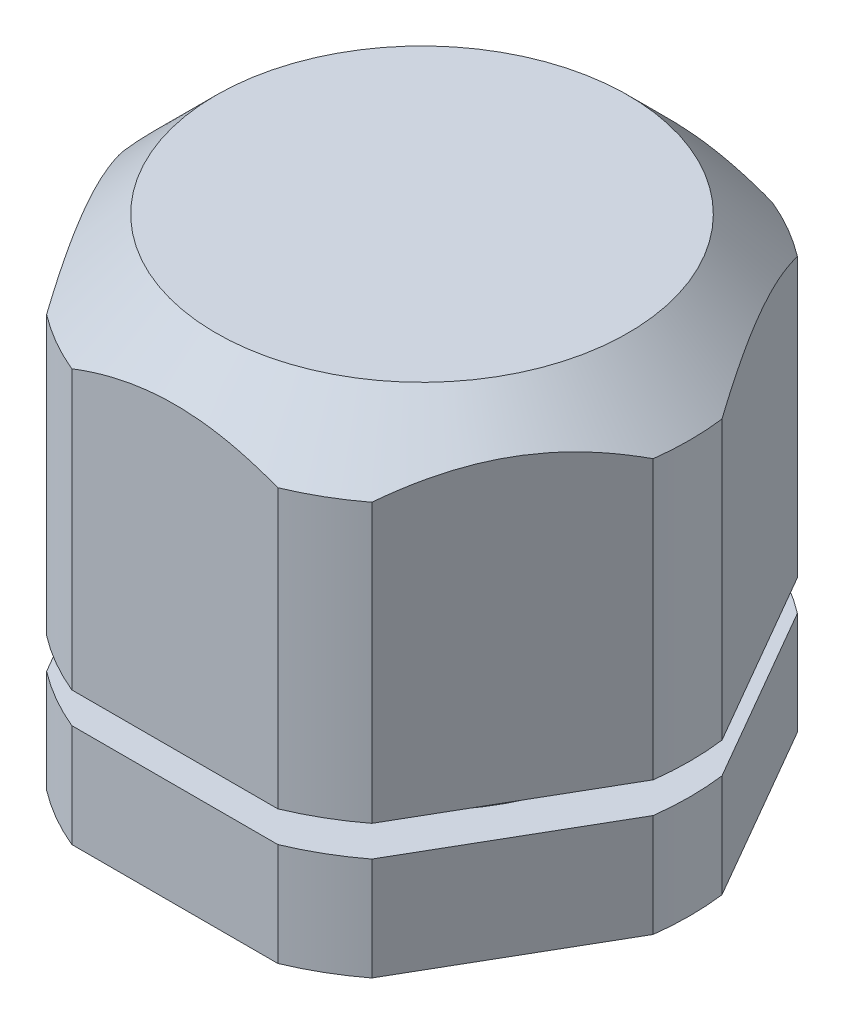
from build123d import *

# Parameters (mm, degrees)
BASE_EXTRUSION_DEPTH    = 23
ESQUISSE3_R             = 13.856406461
ESQUISSE3_R_2           = 13
ENL_V_MAT_EXTRU_1_DEPTH = 30.41088234
ESQUISSE4_W             = 3
ESQUISSE4_H             = 1.5


with BuildPart() as part:
    # Esquisse2 → Base-Extrusion (new body)
    with BuildSketch(Plane(origin=(0, 0, 0), x_dir=(1, 0, 0), z_dir=(0, 1, 0))):
        Polygon((13.856406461, 0), (6.92820323, 12), (-6.92820323, 12), (-13.856406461, 0), (-6.92820323, -12), (6.92820323, -12), align=None)
    extrude(amount=BASE_EXTRUSION_DEPTH)

    # Esquisse3 → Enl_v. mat.-Extru.1 (cut, through all)
    with BuildSketch(Plane(origin=(0, 23, 0), x_dir=(-1, 0, 0), z_dir=(0, 1, 0))):
        Circle(ESQUISSE3_R)
        Circle(ESQUISSE3_R_2, mode=Mode.SUBTRACT)
    extrude(amount=-ENL_V_MAT_EXTRU_1_DEPTH, mode=Mode.SUBTRACT)

    # Esquisse4 → Enl_vement de mati_re-R_volution1 (revolve, cut)
    with BuildSketch(Plane.XY, mode=Mode.PRIVATE) as enl_vement_de_mati_re_r_volution1_sk:
        with Locations((11.5, 5.75)):
            Rectangle(ESQUISSE4_W, ESQUISSE4_H)
        Polygon((10, 23), (13, 20), (13, 23), align=None)
    revolve(enl_vement_de_mati_re_r_volution1_sk.sketch.rotate(Axis((0, 6.229090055, 0), (0, -1, 0)), 180), axis=Axis((0, 6.229090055, 0), (0, -1, 0)), mode=Mode.SUBTRACT)


solid = part.part
